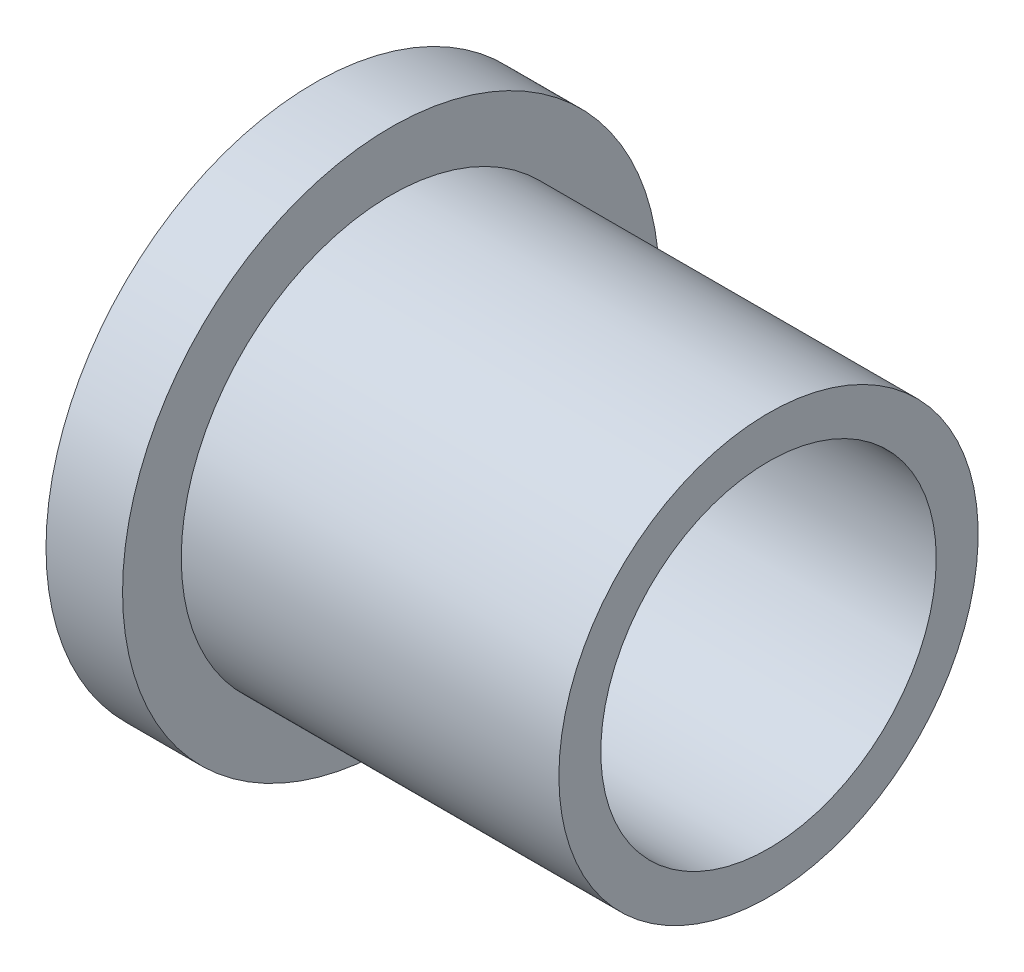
ISO-10303-21;
HEADER;
FILE_DESCRIPTION(('STEP AP214'),'2;1');
FILE_NAME('part.step','',(''),(''),'','','');
FILE_SCHEMA(('AUTOMOTIVE_DESIGN { 1 0 10303 214 1 1 1 1 }'));
ENDSEC;
DATA;
#1=APPLICATION_CONTEXT('core data for automotive mechanical design processes');
#2=APPLICATION_PROTOCOL_DEFINITION('international standard','automotive_design',2000,#1);
#3=PRODUCT_CONTEXT('',#1,'mechanical');
#4=PRODUCT('Part','Part','',(#3));
#5=PRODUCT_RELATED_PRODUCT_CATEGORY('part','',(#4));
#6=PRODUCT_DEFINITION_FORMATION('','',#4);
#7=PRODUCT_DEFINITION_CONTEXT('part definition',#1,'design');
#8=PRODUCT_DEFINITION('design','',#6,#7);
#9=PRODUCT_DEFINITION_SHAPE('','',#8);
#10=(LENGTH_UNIT() NAMED_UNIT(*) SI_UNIT(.MILLI.,.METRE.));
#11=(NAMED_UNIT(*) PLANE_ANGLE_UNIT() SI_UNIT($,.RADIAN.));
#12=(NAMED_UNIT(*) SI_UNIT($,.STERADIAN.) SOLID_ANGLE_UNIT());
#13=UNCERTAINTY_MEASURE_WITH_UNIT(LENGTH_MEASURE(1.E-05),#10,'distance_accuracy_value','');
#14=(GEOMETRIC_REPRESENTATION_CONTEXT(3) GLOBAL_UNCERTAINTY_ASSIGNED_CONTEXT((#13)) GLOBAL_UNIT_ASSIGNED_CONTEXT((#10,
#11,#12)) REPRESENTATION_CONTEXT('',''));
#15=CARTESIAN_POINT('',(0.,0.,0.));
#16=DIRECTION('',(0.,0.,1.));
#17=DIRECTION('',(1.,0.,0.));
#18=AXIS2_PLACEMENT_3D('',#15,#16,#17);
#19=CARTESIAN_POINT('',(-10.0605365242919,16.,0.));
#20=DIRECTION('',(-1.,0.,0.));
#21=DIRECTION('',(0.,0.,1.));
#22=AXIS2_PLACEMENT_3D('',#19,#20,#21);
#23=PLANE('',#22);
#24=CARTESIAN_POINT('',(-10.0605365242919,0.,0.));
#25=DIRECTION('',(-1.,0.,0.));
#26=DIRECTION('',(0.,0.,1.));
#27=AXIS2_PLACEMENT_3D('',#24,#25,#26);
#28=CIRCLE('',#27,16.);
#29=CARTESIAN_POINT('',(-10.0605365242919,0.,16.));
#30=VERTEX_POINT('',#29);
#31=EDGE_CURVE('E12',#30,#30,#28,.T.);
#32=ORIENTED_EDGE('',*,*,#31,.F.);
#33=EDGE_LOOP('',(#32));
#34=FACE_BOUND('',#33,.T.);
#35=CARTESIAN_POINT('',(-10.0605365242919,0.,0.));
#36=DIRECTION('',(-1.,0.,0.));
#37=DIRECTION('',(0.,0.,1.));
#38=AXIS2_PLACEMENT_3D('',#35,#36,#37);
#39=CIRCLE('',#38,12.5);
#40=CARTESIAN_POINT('',(-10.0605365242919,0.,12.5));
#41=VERTEX_POINT('',#40);
#42=EDGE_CURVE('E62',#41,#41,#39,.T.);
#43=ORIENTED_EDGE('',*,*,#42,.T.);
#44=EDGE_LOOP('',(#43));
#45=FACE_BOUND('',#44,.T.);
#46=ADVANCED_FACE('F48',(#34,#45),#23,.F.);
#47=CARTESIAN_POINT('',(-46.6574391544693,1.38777878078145E-13,0.));
#48=DIRECTION('',(-1.,0.,0.));
#49=DIRECTION('',(0.,0.,1.));
#50=AXIS2_PLACEMENT_3D('',#47,#48,#49);
#51=CYLINDRICAL_SURFACE('',#50,16.);
#52=CARTESIAN_POINT('',(-14.6254778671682,0.,0.));
#53=DIRECTION('',(-1.,0.,0.));
#54=DIRECTION('',(0.,0.,1.));
#55=AXIS2_PLACEMENT_3D('',#52,#53,#54);
#56=CIRCLE('',#55,16.);
#57=CARTESIAN_POINT('',(-14.6254778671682,0.,16.));
#58=VERTEX_POINT('',#57);
#59=EDGE_CURVE('E54',#58,#58,#56,.T.);
#60=ORIENTED_EDGE('',*,*,#59,.F.);
#61=EDGE_LOOP('',(#60));
#62=FACE_BOUND('',#61,.T.);
#63=ORIENTED_EDGE('',*,*,#31,.T.);
#64=EDGE_LOOP('',(#63));
#65=FACE_BOUND('',#64,.T.);
#66=ADVANCED_FACE('F96',(#62,#65),#51,.T.);
#67=CARTESIAN_POINT('',(-14.6254778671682,16.,0.));
#68=DIRECTION('',(1.,0.,0.));
#69=DIRECTION('',(0.,0.,-1.));
#70=AXIS2_PLACEMENT_3D('',#67,#68,#69);
#71=PLANE('',#70);
#72=CARTESIAN_POINT('',(-14.6254778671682,0.,0.));
#73=DIRECTION('',(1.,0.,0.));
#74=DIRECTION('',(0.,0.,-1.));
#75=AXIS2_PLACEMENT_3D('',#72,#73,#74);
#76=CIRCLE('',#75,10.);
#77=CARTESIAN_POINT('',(-14.6254778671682,0.,-10.));
#78=VERTEX_POINT('',#77);
#79=EDGE_CURVE('E67',#78,#78,#76,.T.);
#80=ORIENTED_EDGE('',*,*,#79,.T.);
#81=EDGE_LOOP('',(#80));
#82=FACE_BOUND('',#81,.T.);
#83=ORIENTED_EDGE('',*,*,#59,.T.);
#84=EDGE_LOOP('',(#83));
#85=FACE_BOUND('',#84,.T.);
#86=ADVANCED_FACE('F74',(#82,#85),#71,.F.);
#87=CARTESIAN_POINT('',(12.4546826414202,12.5,0.));
#88=DIRECTION('',(-1.,0.,0.));
#89=DIRECTION('',(0.,0.,1.));
#90=AXIS2_PLACEMENT_3D('',#87,#88,#89);
#91=PLANE('',#90);
#92=CARTESIAN_POINT('',(12.4546826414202,0.,0.));
#93=DIRECTION('',(1.,0.,0.));
#94=DIRECTION('',(0.,0.,-1.));
#95=AXIS2_PLACEMENT_3D('',#92,#93,#94);
#96=CIRCLE('',#95,10.);
#97=CARTESIAN_POINT('',(12.4546826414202,0.,-10.));
#98=VERTEX_POINT('',#97);
#99=EDGE_CURVE('E68',#98,#98,#96,.T.);
#100=ORIENTED_EDGE('',*,*,#99,.F.);
#101=EDGE_LOOP('',(#100));
#102=FACE_BOUND('',#101,.T.);
#103=CARTESIAN_POINT('',(12.4546826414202,0.,0.));
#104=DIRECTION('',(-1.,0.,0.));
#105=DIRECTION('',(0.,0.,1.));
#106=AXIS2_PLACEMENT_3D('',#103,#104,#105);
#107=CIRCLE('',#106,12.5);
#108=CARTESIAN_POINT('',(12.4546826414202,0.,12.5));
#109=VERTEX_POINT('',#108);
#110=EDGE_CURVE('E58',#109,#109,#107,.T.);
#111=ORIENTED_EDGE('',*,*,#110,.F.);
#112=EDGE_LOOP('',(#111));
#113=FACE_BOUND('',#112,.T.);
#114=ADVANCED_FACE('F83',(#102,#113),#91,.F.);
#115=CARTESIAN_POINT('',(-46.6574391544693,1.38777878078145E-13,0.));
#116=DIRECTION('',(-1.,0.,0.));
#117=DIRECTION('',(0.,0.,1.));
#118=AXIS2_PLACEMENT_3D('',#115,#116,#117);
#119=CYLINDRICAL_SURFACE('',#118,12.5);
#120=ORIENTED_EDGE('',*,*,#42,.F.);
#121=EDGE_LOOP('',(#120));
#122=FACE_BOUND('',#121,.T.);
#123=ORIENTED_EDGE('',*,*,#110,.T.);
#124=EDGE_LOOP('',(#123));
#125=FACE_BOUND('',#124,.T.);
#126=ADVANCED_FACE('F79',(#122,#125),#119,.T.);
#127=CARTESIAN_POINT('',(-14.6254778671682,0.,0.));
#128=DIRECTION('',(1.,0.,0.));
#129=DIRECTION('',(0.,0.,-1.));
#130=AXIS2_PLACEMENT_3D('',#127,#128,#129);
#131=CYLINDRICAL_SURFACE('',#130,10.);
#132=ORIENTED_EDGE('',*,*,#79,.F.);
#133=EDGE_LOOP('',(#132));
#134=FACE_BOUND('',#133,.T.);
#135=ORIENTED_EDGE('',*,*,#99,.T.);
#136=EDGE_LOOP('',(#135));
#137=FACE_BOUND('',#136,.T.);
#138=ADVANCED_FACE('F76',(#134,#137),#131,.F.);
#139=CLOSED_SHELL('',(#46,#66,#86,#114,#126,#138));
#140=MANIFOLD_SOLID_BREP('B2',#139);
#141=ADVANCED_BREP_SHAPE_REPRESENTATION('',(#18,#140),#14);
#142=SHAPE_DEFINITION_REPRESENTATION(#9,#141);
ENDSEC;
END-ISO-10303-21;
